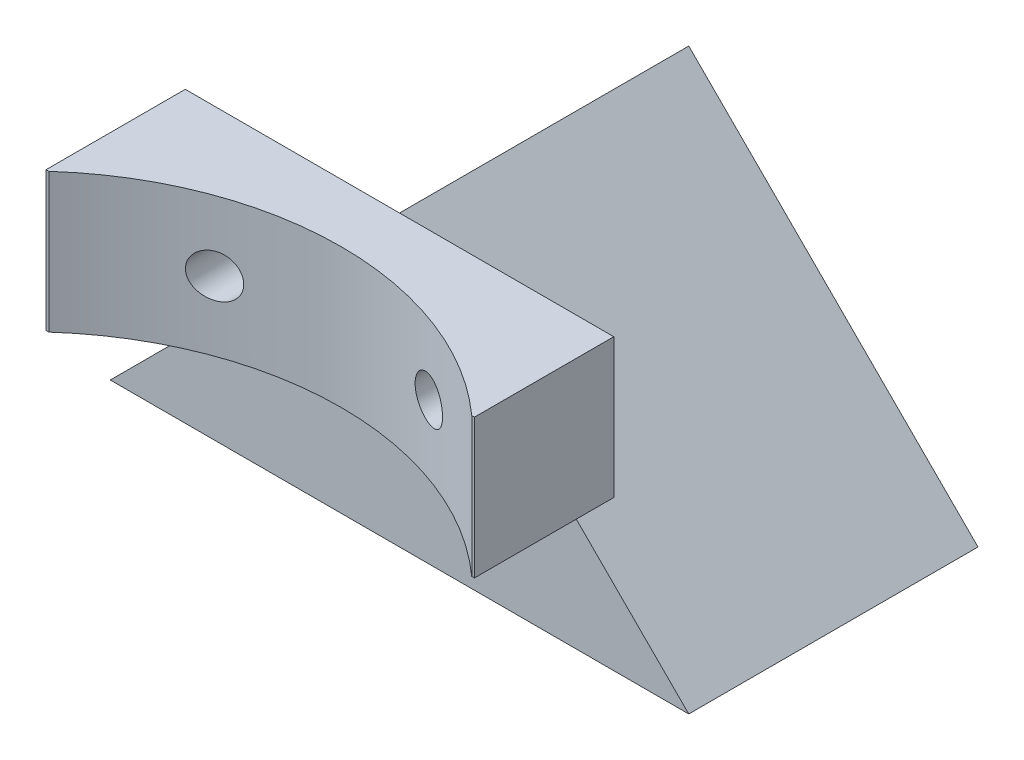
from build123d import *

# Parameters (mm, degrees)
ESQUISSE1_W              = 54
ESQUISSE1_H              = 27
BOSS_EXTRU_1_DEPTH       = 27
ENL_V_MAT_EXTRU_1_DEPTH  = 27
ENL_V_MAT_EXTRU_2_DEPTH  = 27
ESQUISSE4_W              = 40
ESQUISSE4_H              = 13
BOSS_EXTRU_3_DEPTH       = 13
ESQUISSE5_R              = 2
ENL_V_MAT_EXTRU_3_DEPTH  = 13
ESQUISSE6_R              = 29.56
ENL_V_MAT_EXTRU_16_DEPTH = 21


with BuildPart() as part:
    # Esquisse1 → Boss.-Extru.1 (new body)
    with BuildSketch(Plane.XY):
        with Locations((-3.777331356, 4.233569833)):
            Rectangle(ESQUISSE1_W, ESQUISSE1_H)
    extrude(amount=BOSS_EXTRU_1_DEPTH)

    # Esquisse2 → Enl_v. mat.-Extru.1 (cut)
    with BuildSketch(Plane(origin=(0, 0, 0), x_dir=(-1, 0, 0), z_dir=(0, 0, -1))):
        Polygon((-23.222668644, -9.266430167), (3.777331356, 17.733569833), (-23.222668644, 17.733569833), align=None)
    extrude(amount=-ENL_V_MAT_EXTRU_1_DEPTH, mode=Mode.SUBTRACT)

    # Esquisse3 → Enl_v. mat.-Extru.2 (cut)
    with BuildSketch(Plane(origin=(0, 0, 0), x_dir=(-1, 0, 0), z_dir=(0, 0, -1))):
        Polygon((30.777331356, -9.266430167), (3.777331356, 17.733569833), (30.777331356, 17.733569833), align=None)
    extrude(amount=-ENL_V_MAT_EXTRU_2_DEPTH, mode=Mode.SUBTRACT)

    # Esquisse4 → Boss.-Extru.3 (add)
    with BuildSketch(Plane.XY.offset(27)):
        with Locations((-3.777331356, 11.233569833)):
            Rectangle(ESQUISSE4_W, ESQUISSE4_H)
    extrude(amount=BOSS_EXTRU_3_DEPTH)

    # Esquisse5 → Enl_v. mat.-Extru.3 (cut)
    with BuildSketch(Plane.XY.offset(40)):
        with Locations((6.222668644, 11.233569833)):
            Circle(ESQUISSE5_R)
        with Locations((-13.777331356, 11.233569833)):
            Circle(ESQUISSE5_R)
    extrude(amount=-ENL_V_MAT_EXTRU_3_DEPTH, mode=Mode.SUBTRACT)

    # Esquisse6 → Enl_v. mat.-Extru.16 (cut)
    with BuildSketch(Plane(origin=(0, 17.733569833, 0), x_dir=(1, 0, 0), z_dir=(0, 1, 0))):
        with Locations((-3.777331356, -62)):
            Circle(ESQUISSE6_R)
    extrude(amount=-ENL_V_MAT_EXTRU_16_DEPTH, mode=Mode.SUBTRACT)


solid = part.part
